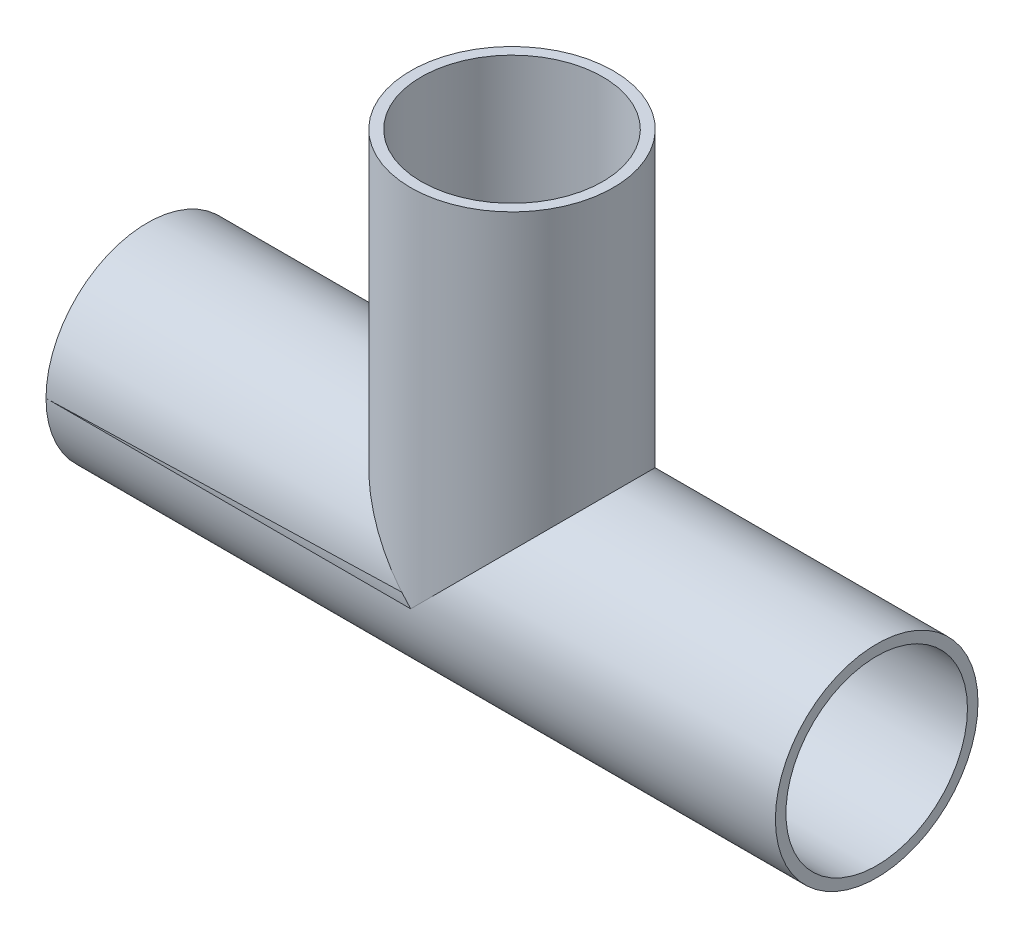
from build123d import *

# Parameters (mm, degrees)
SKETCH1_R           = 15.875
BOSS_EXTRUDE1_DEPTH = 57.15
SKETCH2_R           = 15.875
BOSS_EXTRUDE2_DEPTH = 57.15
SKETCH3_R           = 14.224
CUT_EXTRUDE1_DEPTH  = 57.15
SKETCH4_R           = 14.224
CUT_EXTRUDE2_DEPTH  = 129.773553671


with BuildPart() as part:
    # Sketch1 → Boss-Extrude1 (new body)
    with BuildSketch(Plane(origin=(0, 0, 0), x_dir=(1, 0, 0), z_dir=(0, 1, 0))):
        with Locations(Location((0, 0, 0), (0, 0, 270))):
            Circle(SKETCH1_R)
    extrude(amount=BOSS_EXTRUDE1_DEPTH)

    # Sketch2 → Boss-Extrude2 (add, symmetric)
    with BuildSketch(Plane(origin=(0, 0, 0), x_dir=(0, 0, -1), z_dir=(1, 0, 0))):
        Circle(SKETCH2_R)
    extrude(amount=BOSS_EXTRUDE2_DEPTH, both=True)

    # Sketch3 → Cut-Extrude1 (cut)
    with BuildSketch(Plane(origin=(0, 57.15, 0), x_dir=(1, 0, 0), z_dir=(0, 1, 0))):
        with Locations(Location((0, 0, 0), (0, 0, 270))):
            Circle(SKETCH3_R)
    extrude(amount=-CUT_EXTRUDE1_DEPTH, mode=Mode.SUBTRACT)

    # Sketch4 → Cut-Extrude2 (cut, through all)
    with BuildSketch(Plane(origin=(57.15, 0, 0), x_dir=(0, 0, -1), z_dir=(1, 0, 0))):
        Circle(SKETCH4_R)
    extrude(amount=-CUT_EXTRUDE2_DEPTH, mode=Mode.SUBTRACT)


solid = part.part
